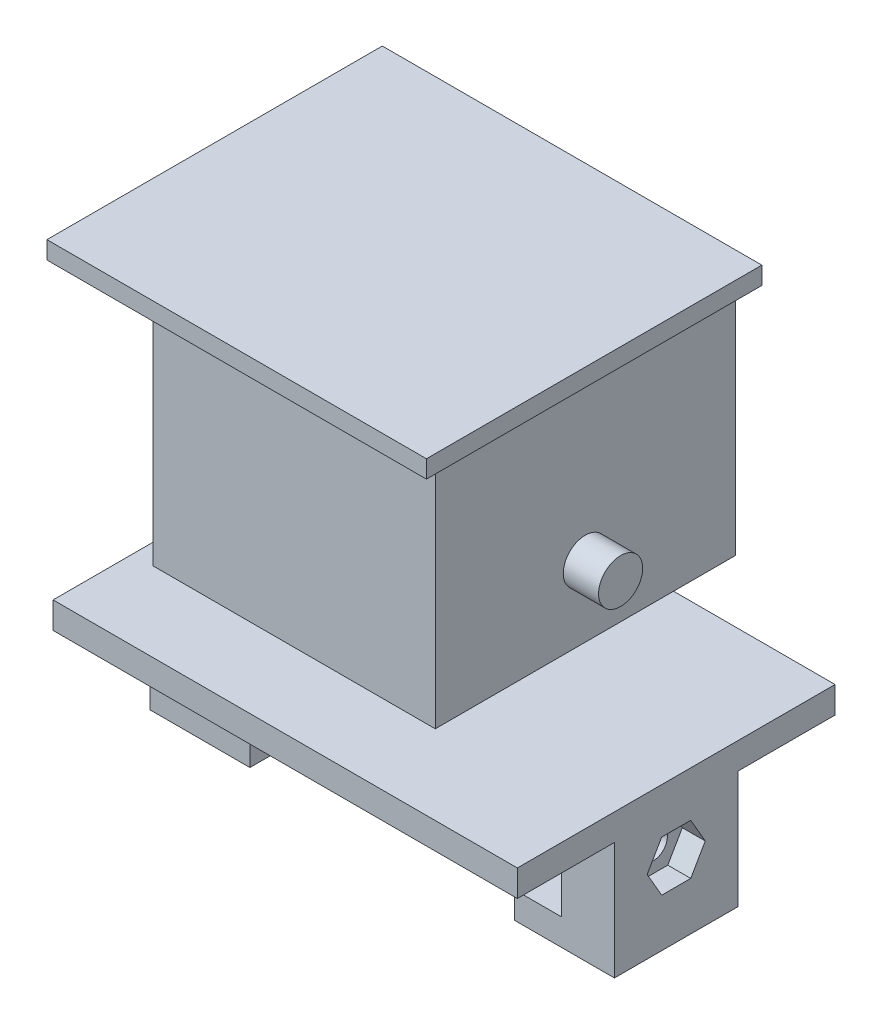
from build123d import *

# Parameters (mm, degrees)
SKETCH_MOUNT_CAP_52P6X36X3_W       = 52.6
SKETCH_MOUNT_CAP_52P6X36X3_H       = 3
MOUNT_CAP_52P6X36X3_DEPTH          = 18
SKETCH_CLAMP_RIGHT_CHEEK_W         = 6
SKETCH_CLAMP_RIGHT_CHEEK_H         = 16.3
CLAMP_RIGHT_CHEEK_DEPTH            = 7
SKETCH_CLAMP_LEFT_CHEEK_W          = 6
SKETCH_CLAMP_LEFT_CHEEK_H          = 16.3
CLAMP_LEFT_CHEEK_DEPTH             = 7
SKETCH_CLAMP_RIGHT_UNDERLIP_W      = 11.3
SKETCH_CLAMP_RIGHT_UNDERLIP_H      = 3
CLAMP_RIGHT_UNDERLIP_DEPTH         = 7
SKETCH_CLAMP_LEFT_UNDERLIP_W       = 11.3
SKETCH_CLAMP_LEFT_UNDERLIP_H       = 3
CLAMP_LEFT_UNDERLIP_DEPTH          = 7
SKETCH_CAMERA_PEDESTAL_14X14X8_W   = 14
SKETCH_CAMERA_PEDESTAL_14X14X8_H   = 8
CAMERA_PEDESTAL_14X14X8_DEPTH      = 7
SKETCH_CAMERA_ENCLOSURE_32X34X26_W = 32
SKETCH_CAMERA_ENCLOSURE_32X34X26_H = 26
CAMERA_ENCLOSURE_32X34X26_DEPTH    = 17
SKETCH_SUN_VISOR_43X38X2_W         = 43
SKETCH_SUN_VISOR_43X38X2_H         = 2
SUN_VISOR_43X38X2_DEPTH            = 19
LENS_BARREL_D20_START              = -16
SKETCH_LENS_BARREL_D20_R           = 10
LENS_BARREL_D20_DEPTH              = 5
LENS_FOCUS_RING_D16_START          = -21
SKETCH_LENS_FOCUS_RING_D16_R       = 8
LENS_FOCUS_RING_D16_DEPTH          = 3
LENS_GLASS_D13P6_START             = -24
SKETCH_LENS_GLASS_D13P6_R          = 6.8
LENS_GLASS_D13P6_DEPTH             = 0.7
IR_WINDOW_LEFT_D4_START            = -16
SKETCH_IR_WINDOW_LEFT_D4_R         = 2
IR_WINDOW_LEFT_D4_DEPTH            = 0.6
IR_WINDOW_RIGHT_D4_START           = -16
SKETCH_IR_WINDOW_RIGHT_D4_R        = 2
IR_WINDOW_RIGHT_D4_DEPTH           = 0.6
REAR_CABLE_GLAND_D5_START          = 16
SKETCH_REAR_CABLE_GLAND_D5_R       = 2.5
REAR_CABLE_GLAND_D5_DEPTH          = 4
SKETCH_CLAMP_2XD3P2_M3_CLEARANCE_R = 1.6
CLAMP_2XD3P2_ATYMINUS5Z0_DEPTH     = 30
M3_NUT_AF5P7_DEPTH2P6_FALSE_START  = 26.3
M3_NUT_AF5P7_DEPTH2P6_FALSE_DEPTH  = 2.6
M3_NUT_AF5P7_DEPTH2P6_TRUE_START   = -26.3
M3_NUT_AF5P7_DEPTH2P6_TRUE_DEPTH   = 2.6


with BuildPart() as part:
    # Sketch_Mount_Cap_52p6x36x3 → Mount_Cap_52p6x36x3 (new, symmetric)
    with BuildSketch(Plane.XY):
        with Locations((0, 1.5)):
            Rectangle(SKETCH_MOUNT_CAP_52P6X36X3_W, SKETCH_MOUNT_CAP_52P6X36X3_H)
    extrude(amount=MOUNT_CAP_52P6X36X3_DEPTH, both=True)

    # Sketch_Clamp_Right_Cheek → Clamp_Right_Cheek (add, symmetric)
    with BuildSketch(Plane.XY):
        with Locations((23.3, -5.15)):
            Rectangle(SKETCH_CLAMP_RIGHT_CHEEK_W, SKETCH_CLAMP_RIGHT_CHEEK_H)
    extrude(amount=CLAMP_RIGHT_CHEEK_DEPTH, both=True)

    # Sketch_Clamp_Left_Cheek → Clamp_Left_Cheek (add, symmetric)
    with BuildSketch(Plane.XY):
        with Locations((-23.3, -5.15)):
            Rectangle(SKETCH_CLAMP_LEFT_CHEEK_W, SKETCH_CLAMP_LEFT_CHEEK_H)
    extrude(amount=CLAMP_LEFT_CHEEK_DEPTH, both=True)

    # Sketch_Clamp_Right_Underlip → Clamp_Right_Underlip (add, symmetric)
    with BuildSketch(Plane.XY):
        with Locations((20.65, -11.8)):
            Rectangle(SKETCH_CLAMP_RIGHT_UNDERLIP_W, SKETCH_CLAMP_RIGHT_UNDERLIP_H)
    extrude(amount=CLAMP_RIGHT_UNDERLIP_DEPTH, both=True)

    # Sketch_Clamp_Left_Underlip → Clamp_Left_Underlip (add, symmetric)
    with BuildSketch(Plane.XY):
        with Locations((-20.65, -11.8)):
            Rectangle(SKETCH_CLAMP_LEFT_UNDERLIP_W, SKETCH_CLAMP_LEFT_UNDERLIP_H)
    extrude(amount=CLAMP_LEFT_UNDERLIP_DEPTH, both=True)

    # Sketch_Camera_Pedestal_14x14x8 → Camera_Pedestal_14x14x8 (add, symmetric)
    with BuildSketch(Plane.XY):
        with Locations((0, 7)):
            Rectangle(SKETCH_CAMERA_PEDESTAL_14X14X8_W, SKETCH_CAMERA_PEDESTAL_14X14X8_H)
    extrude(amount=CAMERA_PEDESTAL_14X14X8_DEPTH, both=True)

    # Sketch_Camera_Enclosure_32x34x26 → Camera_Enclosure_32x34x26 (add, symmetric)
    with BuildSketch(Plane.XY):
        with Locations((0, 24)):
            Rectangle(SKETCH_CAMERA_ENCLOSURE_32X34X26_W, SKETCH_CAMERA_ENCLOSURE_32X34X26_H)
    extrude(amount=CAMERA_ENCLOSURE_32X34X26_DEPTH, both=True)

    # Sketch_Sun_Visor_43x38x2 → Sun_Visor_43x38x2 (add, symmetric)
    with BuildSketch(Plane.XY):
        with Locations((-4.5, 38)):
            Rectangle(SKETCH_SUN_VISOR_43X38X2_W, SKETCH_SUN_VISOR_43X38X2_H)
    extrude(amount=SUN_VISOR_43X38X2_DEPTH, both=True)

    # Sketch_Lens_Barrel_D20 → Lens_Barrel_D20 (add)
    with BuildSketch(Plane(origin=(0, 0, 0), x_dir=(0, 0, -1), z_dir=(1, 0, 0)).offset(LENS_BARREL_D20_START)):
        with Locations((0, 24)):
            Circle(SKETCH_LENS_BARREL_D20_R)
    extrude(amount=-LENS_BARREL_D20_DEPTH)

    # Sketch_Lens_Focus_Ring_D16 → Lens_Focus_Ring_D16 (add)
    with BuildSketch(Plane(origin=(0, 0, 0), x_dir=(0, 0, -1), z_dir=(1, 0, 0)).offset(LENS_FOCUS_RING_D16_START)):
        with Locations((0, 24)):
            Circle(SKETCH_LENS_FOCUS_RING_D16_R)
    extrude(amount=-LENS_FOCUS_RING_D16_DEPTH)

    # Sketch_Lens_Glass_D13p6 → Lens_Glass_D13p6 (add)
    with BuildSketch(Plane(origin=(0, 0, 0), x_dir=(0, 0, -1), z_dir=(1, 0, 0)).offset(LENS_GLASS_D13P6_START)):
        with Locations((0, 24)):
            Circle(SKETCH_LENS_GLASS_D13P6_R)
    extrude(amount=-LENS_GLASS_D13P6_DEPTH)

    # Sketch_IR_Window_Left_D4 → IR_Window_Left_D4 (add)
    with BuildSketch(Plane(origin=(0, 0, 0), x_dir=(0, 0, -1), z_dir=(1, 0, 0)).offset(IR_WINDOW_LEFT_D4_START)):
        with Locations((11, 31)):
            Circle(SKETCH_IR_WINDOW_LEFT_D4_R)
    extrude(amount=-IR_WINDOW_LEFT_D4_DEPTH)

    # Sketch_IR_Window_Right_D4 → IR_Window_Right_D4 (add)
    with BuildSketch(Plane(origin=(0, 0, 0), x_dir=(0, 0, -1), z_dir=(1, 0, 0)).offset(IR_WINDOW_RIGHT_D4_START)):
        with Locations((-11, 31)):
            Circle(SKETCH_IR_WINDOW_RIGHT_D4_R)
    extrude(amount=-IR_WINDOW_RIGHT_D4_DEPTH)

    # Sketch_Rear_Cable_Gland_D5 → Rear_Cable_Gland_D5 (add)
    with BuildSketch(Plane(origin=(0, 0, 0), x_dir=(0, 0, -1), z_dir=(1, 0, 0)).offset(REAR_CABLE_GLAND_D5_START)):
        with Locations(Location((0, 19, 0), (0, 0, 180))):
            Circle(SKETCH_REAR_CABLE_GLAND_D5_R)
    extrude(amount=REAR_CABLE_GLAND_D5_DEPTH)

    # Sketch_Clamp_2xD3p2_M3_Clearance → Clamp_2xD3p2_AtYminus5Z0 (cut, symmetric)
    with BuildSketch(Plane(origin=(0, 0, 0), x_dir=(0, 0, -1), z_dir=(1, 0, 0))):
        with Locations((0, -5)):
            Circle(SKETCH_CLAMP_2XD3P2_M3_CLEARANCE_R)
    extrude(amount=CLAMP_2XD3P2_ATYMINUS5Z0_DEPTH, both=True, mode=Mode.SUBTRACT)

    # Sketch_M3_NutPocket_False → M3_Nut_AF5p7_Depth2p6_False (cut)
    with BuildSketch(Plane(origin=(0, 0, 0), x_dir=(0, 0, -1), z_dir=(1, 0, 0)).offset(M3_NUT_AF5P7_DEPTH2P6_FALSE_START)):
        Polygon((-3.290896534, -5), (-1.645448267, -2.15), (1.645448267, -2.15), (3.290896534, -5), (1.645448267, -7.85), (-1.645448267, -7.85), align=None)
    extrude(amount=-M3_NUT_AF5P7_DEPTH2P6_FALSE_DEPTH, mode=Mode.SUBTRACT)

    # Sketch_M3_NutPocket_True → M3_Nut_AF5p7_Depth2p6_True (cut)
    with BuildSketch(Plane(origin=(0, 0, 0), x_dir=(0, 0, -1), z_dir=(1, 0, 0)).offset(M3_NUT_AF5P7_DEPTH2P6_TRUE_START)):
        Polygon((-3.290896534, -5), (-1.645448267, -2.15), (1.645448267, -2.15), (3.290896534, -5), (1.645448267, -7.85), (-1.645448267, -7.85), align=None)
    extrude(amount=M3_NUT_AF5P7_DEPTH2P6_TRUE_DEPTH, mode=Mode.SUBTRACT)


solid = part.part
